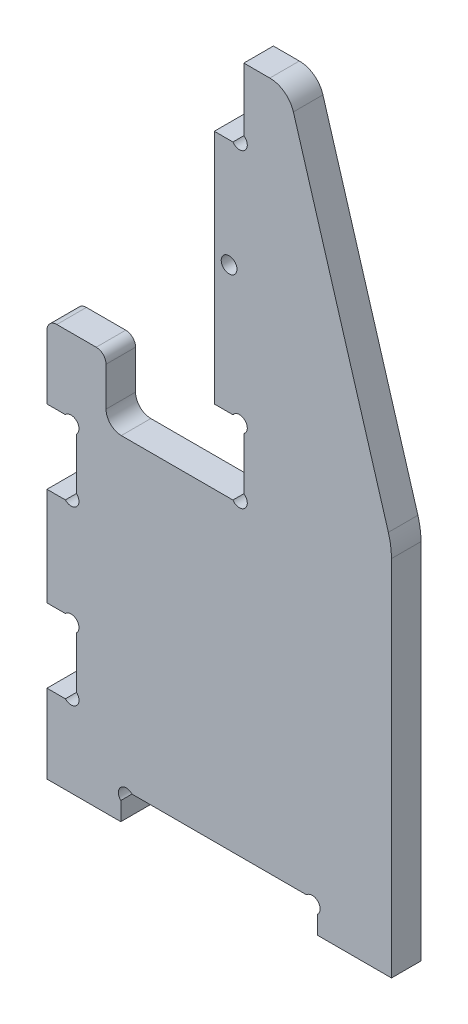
from build123d import *

# Parameters (mm, degrees)
ESQUISSE1_R      = 1.6
EXTRUSION1_DEPTH = 6


with BuildPart() as part:
    # Esquisse1 → Extrusion1 (new body)
    with BuildSketch(Plane.XY):
        with BuildLine():
            Line((-13, 5), (-5, 5))
            ThreePointArc((-5, 5), (-3.585786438, 4.414213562), (-3, 3))
            Line((-3, 3), (-3, -4.9))
            ThreePointArc((-3, -4.9), (-2.092031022, -7.092031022), (0.1, -8))
            Line((0.1, -8), (19, -8))
            Line((19, -8), (22.777124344, -8))
            ThreePointArc((22.777124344, -8), (25.23137085, -8.23137085), (25, -5.777124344))
            Line((25, -5.777124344), (25, 4.777124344))
            ThreePointArc((25, 4.777124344), (25.23137085, 7.23137085), (22.777124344, 7))
            Line((22.777124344, 7), (19, 7))
            Line((19, 7), (19, 55))
            Line((19, 55), (22.777124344, 55))
            ThreePointArc((22.777124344, 55), (25.23137085, 54.76862915), (25, 57.222875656))
            Line((25, 57.222875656), (25, 70))
            Line((25, 70), (30.279846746, 70))
            ThreePointArc((30.279846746, 70), (33.264499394, 69.011464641), (35.068978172, 66.436739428))
            Line((35.068978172, 66.436739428), (54.367394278, 2.108685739))
            ThreePointArc((54.367394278, 2.108685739), (54.841005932, -0.023335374), (55, -2.201532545))
            Line((55, -2.201532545), (55, -76))
            Line((55, -76), (40, -76))
            Line((40, -76), (40, -72.261895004))
            ThreePointArc((40, -72.261895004), (40.03137085, -69.96862915), (37.738104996, -70))
            Line((37.738104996, -70), (25, -70))
            Line((25, -70), (19, -70))
            Line((19, -70), (2.261895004, -70))
            ThreePointArc((2.261895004, -70), (-0.03137085, -69.96862915), (0, -72.261895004))
            Line((0, -72.261895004), (0, -76))
            Line((0, -76), (-15, -76))
            Line((-15, -76), (-15, -60))
            Line((-15, -60), (-11.261895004, -60))
            ThreePointArc((-11.261895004, -60), (-8.96862915, -60.03137085), (-9, -57.738104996))
            Line((-9, -57.738104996), (-9, -47.261895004))
            ThreePointArc((-9, -47.261895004), (-8.96862915, -44.96862915), (-11.261895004, -45))
            Line((-11.261895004, -45), (-15, -45))
            Line((-15, -45), (-15, -25))
            Line((-15, -25), (-11.261895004, -25))
            ThreePointArc((-11.261895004, -25), (-8.96862915, -25.03137085), (-9, -22.738104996))
            Line((-9, -22.738104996), (-9, -12.261895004))
            ThreePointArc((-9, -12.261895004), (-8.96862915, -9.96862915), (-11.261895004, -10))
            Line((-11.261895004, -10), (-15, -10))
            Line((-15, -10), (-15, 3))
            ThreePointArc((-15, 3), (-14.414213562, 4.414213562), (-13, 5))
        make_face()
        with Locations((22, 33)):
            Circle(ESQUISSE1_R, mode=Mode.SUBTRACT)
    extrude(amount=-EXTRUSION1_DEPTH)


solid = part.part
